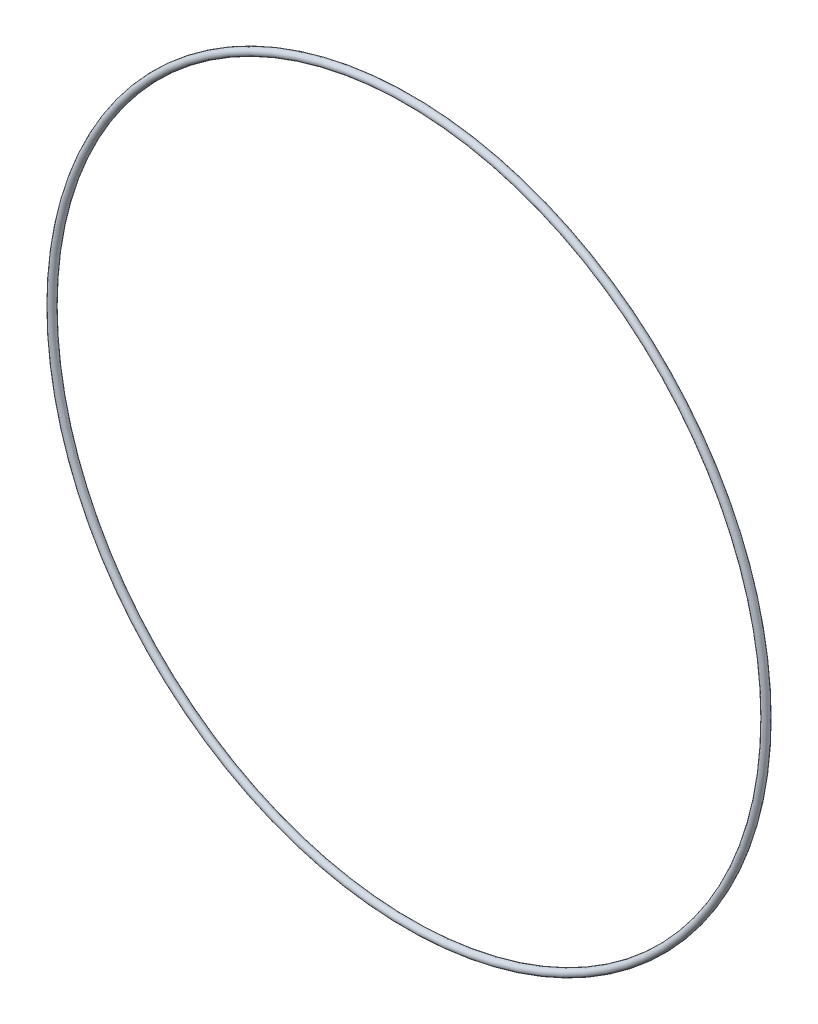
from build123d import *

# Parameters (mm, degrees)
SKETCH1_R = 1.5


with BuildPart() as part:
    # Sketch1 → Revolve1 (revolve)
    with BuildSketch(Plane(origin=(0, 0, 0), x_dir=(1, 0, 0), z_dir=(0, 1, 0))):
        with Locations((-147, 0)):
            Circle(SKETCH1_R)
    revolve(axis=Axis((0, 0, 0), (0, 0, 1)))


solid = part.part
